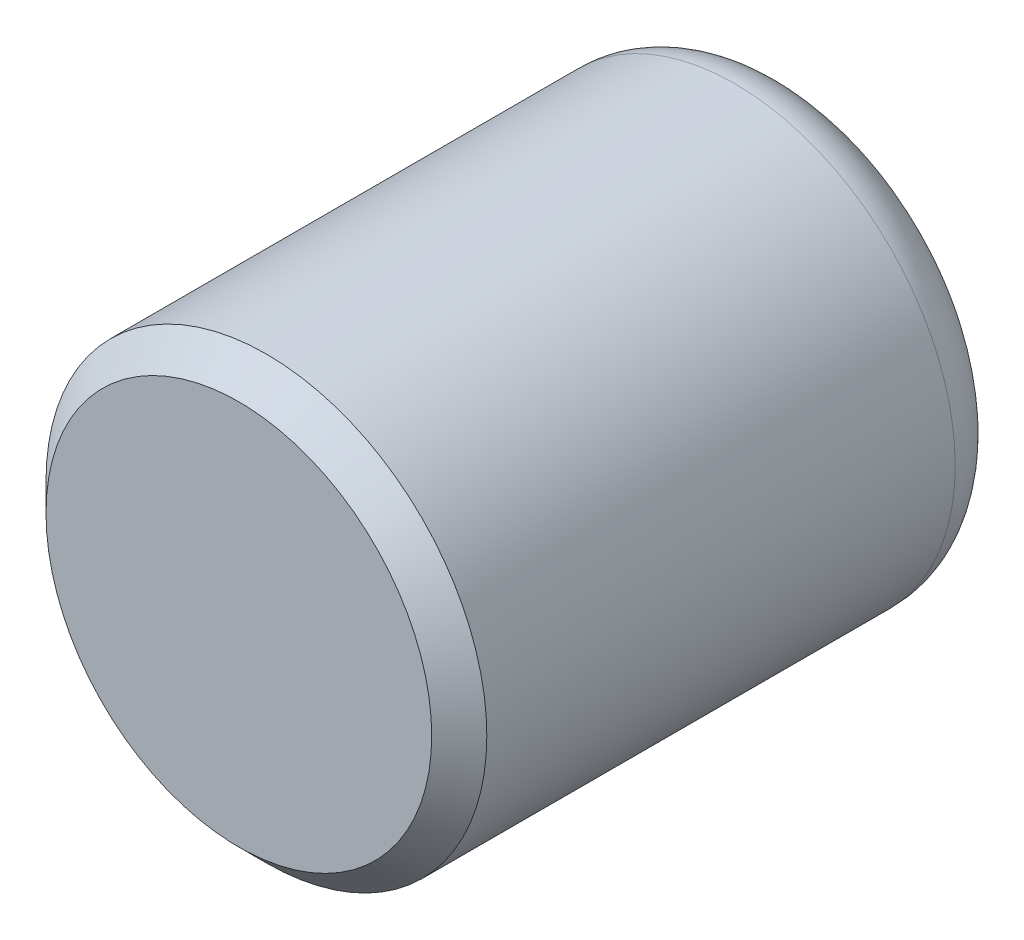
ISO-10303-21;
HEADER;
FILE_DESCRIPTION(('STEP AP214'),'2;1');
FILE_NAME('part.step','',(''),(''),'','','');
FILE_SCHEMA(('AUTOMOTIVE_DESIGN { 1 0 10303 214 1 1 1 1 }'));
ENDSEC;
DATA;
#1=APPLICATION_CONTEXT('core data for automotive mechanical design processes');
#2=APPLICATION_PROTOCOL_DEFINITION('international standard','automotive_design',2000,#1);
#3=PRODUCT_CONTEXT('',#1,'mechanical');
#4=PRODUCT('Part','Part','',(#3));
#5=PRODUCT_RELATED_PRODUCT_CATEGORY('part','',(#4));
#6=PRODUCT_DEFINITION_FORMATION('','',#4);
#7=PRODUCT_DEFINITION_CONTEXT('part definition',#1,'design');
#8=PRODUCT_DEFINITION('design','',#6,#7);
#9=PRODUCT_DEFINITION_SHAPE('','',#8);
#10=(LENGTH_UNIT() NAMED_UNIT(*) SI_UNIT(.MILLI.,.METRE.));
#11=(NAMED_UNIT(*) PLANE_ANGLE_UNIT() SI_UNIT($,.RADIAN.));
#12=(NAMED_UNIT(*) SI_UNIT($,.STERADIAN.) SOLID_ANGLE_UNIT());
#13=UNCERTAINTY_MEASURE_WITH_UNIT(LENGTH_MEASURE(1.E-05),#10,'distance_accuracy_value','');
#14=(GEOMETRIC_REPRESENTATION_CONTEXT(3) GLOBAL_UNCERTAINTY_ASSIGNED_CONTEXT((#13)) GLOBAL_UNIT_ASSIGNED_CONTEXT((#10,
#11,#12)) REPRESENTATION_CONTEXT('',''));
#15=CARTESIAN_POINT('',(0.,0.,0.));
#16=DIRECTION('',(0.,0.,1.));
#17=DIRECTION('',(1.,0.,0.));
#18=AXIS2_PLACEMENT_3D('',#15,#16,#17);
#19=CARTESIAN_POINT('',(0.,0.,-9.99999999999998));
#20=DIRECTION('',(0.,0.,1.));
#21=DIRECTION('',(0.999999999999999,0.,0.));
#22=AXIS2_PLACEMENT_3D('',#19,#20,#21);
#23=PLANE('',#22);
#24=CARTESIAN_POINT('',(0.,0.,-9.99999999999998));
#25=DIRECTION('',(0.,0.,-1.));
#26=DIRECTION('',(-0.999999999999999,0.,0.));
#27=AXIS2_PLACEMENT_3D('',#24,#25,#26);
#28=CIRCLE('',#27,3.);
#29=CARTESIAN_POINT('',(-3.,0.,-9.99999999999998));
#30=VERTEX_POINT('',#29);
#31=EDGE_CURVE('E134',#30,#30,#28,.T.);
#32=ORIENTED_EDGE('',*,*,#31,.T.);
#33=EDGE_LOOP('',(#32));
#34=FACE_BOUND('',#33,.T.);
#35=DIRECTION('',(-0.86602540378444,0.499999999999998,0.));
#36=VECTOR('',#35,1.);
#37=CARTESIAN_POINT('',(0.,2.30940107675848,-9.99999999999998));
#38=LINE('',#37,#36);
#39=CARTESIAN_POINT('',(2.00000000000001,1.15470053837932,-9.99999999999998));
#40=VERTEX_POINT('',#39);
#41=CARTESIAN_POINT('',(0.,2.30940107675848,-9.99999999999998));
#42=VERTEX_POINT('',#41);
#43=EDGE_CURVE('E44',#40,#42,#38,.T.);
#44=ORIENTED_EDGE('',*,*,#43,.T.);
#45=DIRECTION('',(-0.866025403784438,-0.500000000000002,0.));
#46=VECTOR('',#45,1.);
#47=CARTESIAN_POINT('',(0.,2.30940107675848,-9.99999999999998));
#48=LINE('',#47,#46);
#49=CARTESIAN_POINT('',(-1.99999999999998,1.15470053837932,-9.99999999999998));
#50=VERTEX_POINT('',#49);
#51=EDGE_CURVE('E84',#42,#50,#48,.T.);
#52=ORIENTED_EDGE('',*,*,#51,.T.);
#53=DIRECTION('',(0.,-1.,0.));
#54=VECTOR('',#53,1.);
#55=CARTESIAN_POINT('',(-1.99999999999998,-1.15470053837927,-9.99999999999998));
#56=LINE('',#55,#54);
#57=CARTESIAN_POINT('',(-1.99999999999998,-1.15470053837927,-9.99999999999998));
#58=VERTEX_POINT('',#57);
#59=EDGE_CURVE('E92',#50,#58,#56,.T.);
#60=ORIENTED_EDGE('',*,*,#59,.T.);
#61=DIRECTION('',(0.866025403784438,-0.500000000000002,0.));
#62=VECTOR('',#61,1.);
#63=CARTESIAN_POINT('',(0.,-2.30940107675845,-9.99999999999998));
#64=LINE('',#63,#62);
#65=CARTESIAN_POINT('',(0.,-2.30940107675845,-9.99999999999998));
#66=VERTEX_POINT('',#65);
#67=EDGE_CURVE('E107',#58,#66,#64,.T.);
#68=ORIENTED_EDGE('',*,*,#67,.T.);
#69=DIRECTION('',(0.86602540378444,0.499999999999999,0.));
#70=VECTOR('',#69,1.);
#71=CARTESIAN_POINT('',(0.,-2.30940107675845,-9.99999999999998));
#72=LINE('',#71,#70);
#73=CARTESIAN_POINT('',(2.00000000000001,-1.15470053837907,-9.99999999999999));
#74=VERTEX_POINT('',#73);
#75=EDGE_CURVE('E110',#66,#74,#72,.T.);
#76=ORIENTED_EDGE('',*,*,#75,.T.);
#77=DIRECTION('',(0.,1.,0.));
#78=VECTOR('',#77,1.);
#79=CARTESIAN_POINT('',(2.00000000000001,-1.15470053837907,-9.99999999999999));
#80=LINE('',#79,#78);
#81=EDGE_CURVE('E103',#74,#40,#80,.T.);
#82=ORIENTED_EDGE('',*,*,#81,.T.);
#83=EDGE_LOOP('',(#44,#52,#60,#68,#76,#82));
#84=FACE_BOUND('',#83,.T.);
#85=ADVANCED_FACE('F30',(#34,#84),#23,.F.);
#86=CARTESIAN_POINT('',(0.,0.,-8.99999999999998));
#87=DIRECTION('',(0.,0.,-1.));
#88=DIRECTION('',(-0.999999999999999,0.,0.));
#89=AXIS2_PLACEMENT_3D('',#86,#87,#88);
#90=TOROIDAL_SURFACE('',#89,3.,1.);
#91=ORIENTED_EDGE('',*,*,#31,.F.);
#92=EDGE_LOOP('',(#91));
#93=FACE_BOUND('',#92,.T.);
#94=CARTESIAN_POINT('',(0.,0.,-8.99999999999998));
#95=DIRECTION('',(0.,0.,-1.));
#96=DIRECTION('',(-0.999999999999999,0.,0.));
#97=AXIS2_PLACEMENT_3D('',#94,#95,#96);
#98=CIRCLE('',#97,4.);
#99=CARTESIAN_POINT('',(-4.,0.,-8.99999999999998));
#100=VERTEX_POINT('',#99);
#101=EDGE_CURVE('E98',#100,#100,#98,.T.);
#102=ORIENTED_EDGE('',*,*,#101,.T.);
#103=EDGE_LOOP('',(#102));
#104=FACE_BOUND('',#103,.T.);
#105=ADVANCED_FACE('F155',(#93,#104),#90,.T.);
#106=CARTESIAN_POINT('',(0.,0.,0.));
#107=DIRECTION('',(0.,0.,-1.));
#108=DIRECTION('',(-0.999999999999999,0.,0.));
#109=AXIS2_PLACEMENT_3D('',#106,#107,#108);
#110=CYLINDRICAL_SURFACE('',#109,4.);
#111=CARTESIAN_POINT('',(0.,0.,-0.499999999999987));
#112=DIRECTION('',(0.,0.,-1.));
#113=DIRECTION('',(-0.999999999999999,0.,0.));
#114=AXIS2_PLACEMENT_3D('',#111,#112,#113);
#115=CIRCLE('',#114,4.);
#116=CARTESIAN_POINT('',(-4.,0.,-0.499999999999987));
#117=VERTEX_POINT('',#116);
#118=EDGE_CURVE('E37',#117,#117,#115,.T.);
#119=ORIENTED_EDGE('',*,*,#118,.T.);
#120=EDGE_LOOP('',(#119));
#121=FACE_BOUND('',#120,.T.);
#122=ORIENTED_EDGE('',*,*,#101,.F.);
#123=EDGE_LOOP('',(#122));
#124=FACE_BOUND('',#123,.T.);
#125=ADVANCED_FACE('F139',(#121,#124),#110,.T.);
#126=CARTESIAN_POINT('',(0.,0.,0.));
#127=DIRECTION('',(0.,0.,-1.));
#128=DIRECTION('',(-0.999999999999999,0.,0.));
#129=AXIS2_PLACEMENT_3D('',#126,#127,#128);
#130=PLANE('',#129);
#131=CARTESIAN_POINT('',(0.,0.,0.));
#132=DIRECTION('',(0.,0.,-1.));
#133=DIRECTION('',(-0.999999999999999,0.,0.));
#134=AXIS2_PLACEMENT_3D('',#131,#132,#133);
#135=CIRCLE('',#134,3.5);
#136=CARTESIAN_POINT('',(-3.5,0.,0.));
#137=VERTEX_POINT('',#136);
#138=EDGE_CURVE('E11',#137,#137,#135,.F.);
#139=ORIENTED_EDGE('',*,*,#138,.T.);
#140=EDGE_LOOP('',(#139));
#141=FACE_BOUND('',#140,.T.);
#142=ADVANCED_FACE('F165',(#141),#130,.F.);
#143=CARTESIAN_POINT('',(0.,2.30940107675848,-5.99999999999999));
#144=DIRECTION('',(-0.499999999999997,-0.86602540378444,0.));
#145=DIRECTION('',(0.86602540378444,-0.499999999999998,0.));
#146=AXIS2_PLACEMENT_3D('',#143,#144,#145);
#147=PLANE('',#146);
#148=ORIENTED_EDGE('',*,*,#43,.F.);
#149=DIRECTION('',(0.,0.,-1.));
#150=VECTOR('',#149,1.);
#151=CARTESIAN_POINT('',(2.,1.15470053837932,-5.99999999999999));
#152=LINE('',#151,#150);
#153=CARTESIAN_POINT('',(2.,1.15470053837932,-5.99999999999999));
#154=VERTEX_POINT('',#153);
#155=EDGE_CURVE('E123',#154,#40,#152,.T.);
#156=ORIENTED_EDGE('',*,*,#155,.F.);
#157=DIRECTION('',(-0.86602540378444,0.499999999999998,0.));
#158=VECTOR('',#157,1.);
#159=CARTESIAN_POINT('',(0.,2.30940107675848,-5.99999999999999));
#160=LINE('',#159,#158);
#161=CARTESIAN_POINT('',(0.,2.30940107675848,-5.99999999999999));
#162=VERTEX_POINT('',#161);
#163=EDGE_CURVE('E97',#154,#162,#160,.T.);
#164=ORIENTED_EDGE('',*,*,#163,.T.);
#165=DIRECTION('',(0.,0.,-1.));
#166=VECTOR('',#165,1.);
#167=CARTESIAN_POINT('',(0.,2.30940107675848,-5.99999999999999));
#168=LINE('',#167,#166);
#169=EDGE_CURVE('E86',#162,#42,#168,.T.);
#170=ORIENTED_EDGE('',*,*,#169,.T.);
#171=EDGE_LOOP('',(#148,#156,#164,#170));
#172=FACE_BOUND('',#171,.T.);
#173=ADVANCED_FACE('F95',(#172),#147,.T.);
#174=CARTESIAN_POINT('',(0.,2.30940107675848,-5.99999999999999));
#175=DIRECTION('',(0.500000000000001,-0.866025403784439,0.));
#176=DIRECTION('',(0.866025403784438,0.500000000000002,0.));
#177=AXIS2_PLACEMENT_3D('',#174,#175,#176);
#178=PLANE('',#177);
#179=ORIENTED_EDGE('',*,*,#51,.F.);
#180=ORIENTED_EDGE('',*,*,#169,.F.);
#181=DIRECTION('',(-0.866025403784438,-0.500000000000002,0.));
#182=VECTOR('',#181,1.);
#183=CARTESIAN_POINT('',(0.,2.30940107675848,-5.99999999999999));
#184=LINE('',#183,#182);
#185=CARTESIAN_POINT('',(-1.99999999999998,1.15470053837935,-5.99999999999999));
#186=VERTEX_POINT('',#185);
#187=EDGE_CURVE('E114',#162,#186,#184,.T.);
#188=ORIENTED_EDGE('',*,*,#187,.T.);
#189=DIRECTION('',(0.,0.,-1.));
#190=VECTOR('',#189,1.);
#191=CARTESIAN_POINT('',(-1.99999999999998,1.15470053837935,-5.99999999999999));
#192=LINE('',#191,#190);
#193=EDGE_CURVE('E88',#186,#50,#192,.T.);
#194=ORIENTED_EDGE('',*,*,#193,.T.);
#195=EDGE_LOOP('',(#179,#180,#188,#194));
#196=FACE_BOUND('',#195,.T.);
#197=ADVANCED_FACE('F85',(#196),#178,.T.);
#198=CARTESIAN_POINT('',(-1.99999999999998,-1.15470053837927,-5.99999999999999));
#199=DIRECTION('',(0.999999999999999,0.,0.));
#200=DIRECTION('',(0.,0.,-1.));
#201=AXIS2_PLACEMENT_3D('',#198,#199,#200);
#202=PLANE('',#201);
#203=ORIENTED_EDGE('',*,*,#59,.F.);
#204=ORIENTED_EDGE('',*,*,#193,.F.);
#205=DIRECTION('',(0.,-1.,0.));
#206=VECTOR('',#205,1.);
#207=CARTESIAN_POINT('',(-1.99999999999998,-1.15470053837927,-5.99999999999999));
#208=LINE('',#207,#206);
#209=CARTESIAN_POINT('',(-1.99999999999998,-1.15470053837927,-5.99999999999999));
#210=VERTEX_POINT('',#209);
#211=EDGE_CURVE('E116',#186,#210,#208,.T.);
#212=ORIENTED_EDGE('',*,*,#211,.T.);
#213=DIRECTION('',(0.,0.,-1.));
#214=VECTOR('',#213,1.);
#215=CARTESIAN_POINT('',(-1.99999999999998,-1.15470053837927,-5.99999999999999));
#216=LINE('',#215,#214);
#217=EDGE_CURVE('E129',#210,#58,#216,.T.);
#218=ORIENTED_EDGE('',*,*,#217,.T.);
#219=EDGE_LOOP('',(#203,#204,#212,#218));
#220=FACE_BOUND('',#219,.T.);
#221=ADVANCED_FACE('F177',(#220),#202,.T.);
#222=CARTESIAN_POINT('',(0.,-2.30940107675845,-5.99999999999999));
#223=DIRECTION('',(0.500000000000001,0.866025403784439,0.));
#224=DIRECTION('',(-0.866025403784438,0.500000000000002,0.));
#225=AXIS2_PLACEMENT_3D('',#222,#223,#224);
#226=PLANE('',#225);
#227=ORIENTED_EDGE('',*,*,#67,.F.);
#228=ORIENTED_EDGE('',*,*,#217,.F.);
#229=DIRECTION('',(0.866025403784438,-0.500000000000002,0.));
#230=VECTOR('',#229,1.);
#231=CARTESIAN_POINT('',(0.,-2.30940107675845,-5.99999999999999));
#232=LINE('',#231,#230);
#233=CARTESIAN_POINT('',(0.,-2.30940107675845,-5.99999999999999));
#234=VERTEX_POINT('',#233);
#235=EDGE_CURVE('E118',#210,#234,#232,.T.);
#236=ORIENTED_EDGE('',*,*,#235,.T.);
#237=DIRECTION('',(0.,0.,-1.));
#238=VECTOR('',#237,1.);
#239=CARTESIAN_POINT('',(0.,-2.30940107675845,-5.99999999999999));
#240=LINE('',#239,#238);
#241=EDGE_CURVE('E127',#234,#66,#240,.T.);
#242=ORIENTED_EDGE('',*,*,#241,.T.);
#243=EDGE_LOOP('',(#227,#228,#236,#242));
#244=FACE_BOUND('',#243,.T.);
#245=ADVANCED_FACE('F180',(#244),#226,.T.);
#246=CARTESIAN_POINT('',(0.,-2.30940107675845,-5.99999999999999));
#247=DIRECTION('',(-0.499999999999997,0.866025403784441,0.));
#248=DIRECTION('',(-0.86602540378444,-0.499999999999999,0.));
#249=AXIS2_PLACEMENT_3D('',#246,#247,#248);
#250=PLANE('',#249);
#251=ORIENTED_EDGE('',*,*,#75,.F.);
#252=ORIENTED_EDGE('',*,*,#241,.F.);
#253=DIRECTION('',(0.86602540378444,0.499999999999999,0.));
#254=VECTOR('',#253,1.);
#255=CARTESIAN_POINT('',(0.,-2.30940107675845,-5.99999999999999));
#256=LINE('',#255,#254);
#257=CARTESIAN_POINT('',(2.00000000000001,-1.15470053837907,-5.99999999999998));
#258=VERTEX_POINT('',#257);
#259=EDGE_CURVE('E120',#234,#258,#256,.T.);
#260=ORIENTED_EDGE('',*,*,#259,.T.);
#261=DIRECTION('',(0.,0.,-1.));
#262=VECTOR('',#261,1.);
#263=CARTESIAN_POINT('',(2.00000000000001,-1.15470053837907,-5.99999999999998));
#264=LINE('',#263,#262);
#265=EDGE_CURVE('E125',#258,#74,#264,.T.);
#266=ORIENTED_EDGE('',*,*,#265,.T.);
#267=EDGE_LOOP('',(#251,#252,#260,#266));
#268=FACE_BOUND('',#267,.T.);
#269=ADVANCED_FACE('F184',(#268),#250,.T.);
#270=CARTESIAN_POINT('',(2.00000000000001,-1.15470053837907,-5.99999999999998));
#271=DIRECTION('',(-0.999999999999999,0.,0.));
#272=DIRECTION('',(0.,0.,1.));
#273=AXIS2_PLACEMENT_3D('',#270,#271,#272);
#274=PLANE('',#273);
#275=ORIENTED_EDGE('',*,*,#81,.F.);
#276=ORIENTED_EDGE('',*,*,#265,.F.);
#277=DIRECTION('',(0.,1.,0.));
#278=VECTOR('',#277,1.);
#279=CARTESIAN_POINT('',(2.00000000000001,-1.15470053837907,-5.99999999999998));
#280=LINE('',#279,#278);
#281=EDGE_CURVE('E51',#258,#154,#280,.T.);
#282=ORIENTED_EDGE('',*,*,#281,.T.);
#283=ORIENTED_EDGE('',*,*,#155,.T.);
#284=EDGE_LOOP('',(#275,#276,#282,#283));
#285=FACE_BOUND('',#284,.T.);
#286=ADVANCED_FACE('F150',(#285),#274,.T.);
#287=CARTESIAN_POINT('',(2.,1.15470053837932,-5.99999999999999));
#288=DIRECTION('',(0.,0.,1.));
#289=DIRECTION('',(0.999999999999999,0.,0.));
#290=AXIS2_PLACEMENT_3D('',#287,#288,#289);
#291=PLANE('',#290);
#292=ORIENTED_EDGE('',*,*,#163,.F.);
#293=ORIENTED_EDGE('',*,*,#281,.F.);
#294=ORIENTED_EDGE('',*,*,#259,.F.);
#295=ORIENTED_EDGE('',*,*,#235,.F.);
#296=ORIENTED_EDGE('',*,*,#211,.F.);
#297=ORIENTED_EDGE('',*,*,#187,.F.);
#298=EDGE_LOOP('',(#292,#293,#294,#295,#296,#297));
#299=FACE_BOUND('',#298,.T.);
#300=ADVANCED_FACE('F144',(#299),#291,.F.);
#301=CARTESIAN_POINT('',(0.,0.,-0.499999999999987));
#302=DIRECTION('',(0.,0.,-1.));
#303=DIRECTION('',(-0.999999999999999,0.,0.));
#304=AXIS2_PLACEMENT_3D('',#301,#302,#303);
#305=CONICAL_SURFACE('',#304,4.,0.78539816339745);
#306=ORIENTED_EDGE('',*,*,#138,.F.);
#307=EDGE_LOOP('',(#306));
#308=FACE_BOUND('',#307,.T.);
#309=ORIENTED_EDGE('',*,*,#118,.F.);
#310=EDGE_LOOP('',(#309));
#311=FACE_BOUND('',#310,.T.);
#312=ADVANCED_FACE('F142',(#308,#311),#305,.T.);
#313=CLOSED_SHELL('',(#85,#105,#125,#142,#173,#197,#221,#245,#269,#286,#300,#312));
#314=MANIFOLD_SOLID_BREP('B2',#313);
#315=ADVANCED_BREP_SHAPE_REPRESENTATION('',(#18,#314),#14);
#316=SHAPE_DEFINITION_REPRESENTATION(#9,#315);
ENDSEC;
END-ISO-10303-21;
